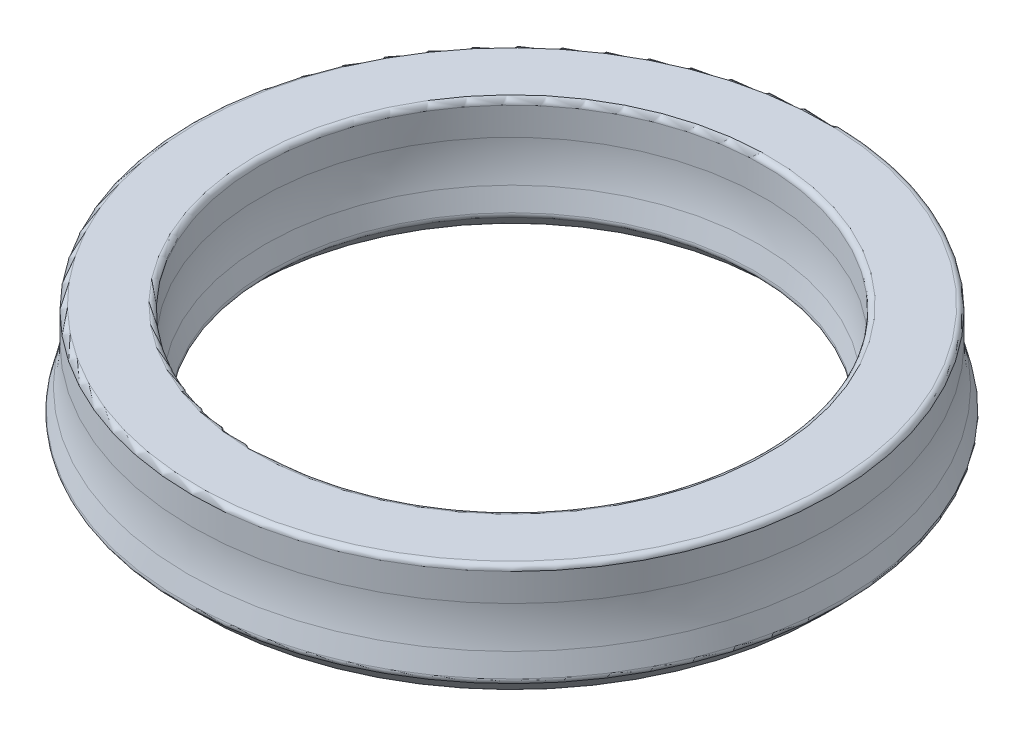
from build123d import *

# Parameters (mm, degrees)
FILLET1_R = 3.81
FILLET2_R = 0.127


with BuildPart() as part:
    # Sketch1 → Revolve1 (revolve)
    with BuildSketch(Plane.XY):
        Polygon((6.35, 0), (5.842, 0.508), (6.096, 1.524), (6.096, 2.794), (7.747, 2.794), (7.747, 1.524), (8.001, 0.508), (7.493, 0), (7.239, 0), (7.239, 2.286), (6.604, 2.286), (6.604, 0), align=None)
    revolve(axis=Axis((0, 0, 0), (0, 1, 0)))

    # Fillet1
    fillet1_edges = [part.edges().sort_by_distance(p)[0] for p in [
        (-6.096, 1.524, 0),
        (-7.747, 1.524, 0),
    ]]
    fillet(fillet1_edges, radius=FILLET1_R)

    # Fillet2
    fillet2_edges = [part.edges().sort_by_distance(p)[0] for p in [
        (-7.493, 0, 0),
        (-7.239, 0, 0),
        (-7.239, 2.286, 0),
        (-6.604, 2.286, 0),
        (-6.604, 0, 0),
        (-6.35, 0, 0),
        (-5.842, 0.508, 0),
        (-6.096, 2.794, 0),
        (-7.747, 2.794, 0),
        (-8.001, 0.508, 0),
    ]]
    fillet(fillet2_edges, radius=FILLET2_R)


solid = part.part
